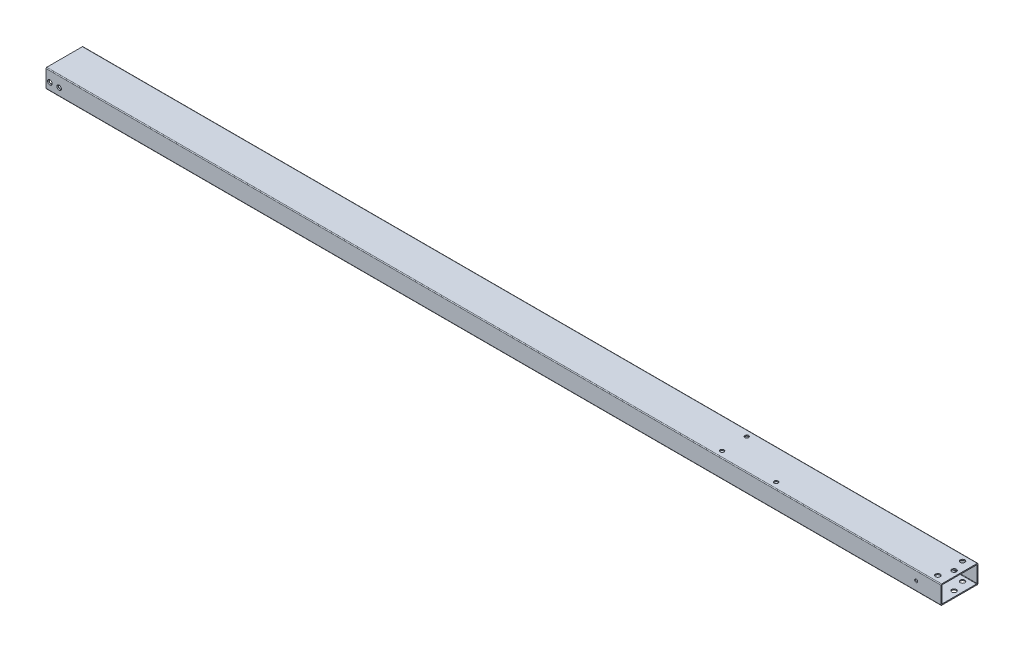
ISO-10303-21;
HEADER;
FILE_DESCRIPTION(('STEP AP214'),'2;1');
FILE_NAME('part.step','',(''),(''),'','','');
FILE_SCHEMA(('AUTOMOTIVE_DESIGN { 1 0 10303 214 1 1 1 1 }'));
ENDSEC;
DATA;
#1=APPLICATION_CONTEXT('core data for automotive mechanical design processes');
#2=APPLICATION_PROTOCOL_DEFINITION('international standard','automotive_design',2000,#1);
#3=PRODUCT_CONTEXT('',#1,'mechanical');
#4=PRODUCT('Part','Part','',(#3));
#5=PRODUCT_RELATED_PRODUCT_CATEGORY('part','',(#4));
#6=PRODUCT_DEFINITION_FORMATION('','',#4);
#7=PRODUCT_DEFINITION_CONTEXT('part definition',#1,'design');
#8=PRODUCT_DEFINITION('design','',#6,#7);
#9=PRODUCT_DEFINITION_SHAPE('','',#8);
#10=(LENGTH_UNIT() NAMED_UNIT(*) SI_UNIT(.MILLI.,.METRE.));
#11=(NAMED_UNIT(*) PLANE_ANGLE_UNIT() SI_UNIT($,.RADIAN.));
#12=(NAMED_UNIT(*) SI_UNIT($,.STERADIAN.) SOLID_ANGLE_UNIT());
#13=UNCERTAINTY_MEASURE_WITH_UNIT(LENGTH_MEASURE(1.E-05),#10,'distance_accuracy_value','');
#14=(GEOMETRIC_REPRESENTATION_CONTEXT(3) GLOBAL_UNCERTAINTY_ASSIGNED_CONTEXT((#13)) GLOBAL_UNIT_ASSIGNED_CONTEXT((#10,
#11,#12)) REPRESENTATION_CONTEXT('',''));
#15=CARTESIAN_POINT('',(0.,0.,0.));
#16=DIRECTION('',(0.,0.,1.));
#17=DIRECTION('',(1.,0.,0.));
#18=AXIS2_PLACEMENT_3D('',#15,#16,#17);
#19=CARTESIAN_POINT('',(1838.325,0.,0.));
#20=DIRECTION('',(1.,0.,0.));
#21=DIRECTION('',(0.,0.,-1.));
#22=AXIS2_PLACEMENT_3D('',#19,#20,#21);
#23=PLANE('',#22);
#24=DIRECTION('',(0.,0.,1.));
#25=VECTOR('',#24,1.);
#26=CARTESIAN_POINT('',(1838.325,19.05,-38.1));
#27=LINE('',#26,#25);
#28=CARTESIAN_POINT('',(1838.325,19.05,-36.5252));
#29=VERTEX_POINT('',#28);
#30=CARTESIAN_POINT('',(1838.325,19.05,36.5252));
#31=VERTEX_POINT('',#30);
#32=EDGE_CURVE('E200',#29,#31,#27,.T.);
#33=ORIENTED_EDGE('',*,*,#32,.T.);
#34=CARTESIAN_POINT('',(1838.325,17.4752,36.5252));
#35=DIRECTION('',(1.,0.,0.));
#36=DIRECTION('',(0.,0.,-1.));
#37=AXIS2_PLACEMENT_3D('',#34,#35,#36);
#38=CIRCLE('',#37,1.5748);
#39=CARTESIAN_POINT('',(1838.325,17.4752,38.1));
#40=VERTEX_POINT('',#39);
#41=EDGE_CURVE('E259',#31,#40,#38,.T.);
#42=ORIENTED_EDGE('',*,*,#41,.T.);
#43=DIRECTION('',(0.,-1.,0.));
#44=VECTOR('',#43,1.);
#45=CARTESIAN_POINT('',(1838.325,19.05,38.1));
#46=LINE('',#45,#44);
#47=CARTESIAN_POINT('',(1838.325,-17.4752,38.1));
#48=VERTEX_POINT('',#47);
#49=EDGE_CURVE('E414',#40,#48,#46,.T.);
#50=ORIENTED_EDGE('',*,*,#49,.T.);
#51=CARTESIAN_POINT('',(1838.325,-17.4752,36.5252));
#52=DIRECTION('',(1.,0.,0.));
#53=DIRECTION('',(0.,0.,-1.));
#54=AXIS2_PLACEMENT_3D('',#51,#52,#53);
#55=CIRCLE('',#54,1.5748);
#56=CARTESIAN_POINT('',(1838.325,-19.05,36.5252));
#57=VERTEX_POINT('',#56);
#58=EDGE_CURVE('E257',#48,#57,#55,.T.);
#59=ORIENTED_EDGE('',*,*,#58,.T.);
#60=DIRECTION('',(0.,0.,-1.));
#61=VECTOR('',#60,1.);
#62=CARTESIAN_POINT('',(1838.325,-19.05,-38.1));
#63=LINE('',#62,#61);
#64=CARTESIAN_POINT('',(1838.325,-19.05,-36.5252));
#65=VERTEX_POINT('',#64);
#66=EDGE_CURVE('E417',#57,#65,#63,.T.);
#67=ORIENTED_EDGE('',*,*,#66,.T.);
#68=CARTESIAN_POINT('',(1838.325,-17.4752,-36.5252));
#69=DIRECTION('',(1.,0.,0.));
#70=DIRECTION('',(0.,0.,-1.));
#71=AXIS2_PLACEMENT_3D('',#68,#69,#70);
#72=CIRCLE('',#71,1.5748);
#73=CARTESIAN_POINT('',(1838.325,-17.4752,-38.1));
#74=VERTEX_POINT('',#73);
#75=EDGE_CURVE('E81',#65,#74,#72,.T.);
#76=ORIENTED_EDGE('',*,*,#75,.T.);
#77=DIRECTION('',(0.,1.,0.));
#78=VECTOR('',#77,1.);
#79=CARTESIAN_POINT('',(1838.325,19.05,-38.1));
#80=LINE('',#79,#78);
#81=CARTESIAN_POINT('',(1838.325,17.4752,-38.1));
#82=VERTEX_POINT('',#81);
#83=EDGE_CURVE('E205',#74,#82,#80,.T.);
#84=ORIENTED_EDGE('',*,*,#83,.T.);
#85=CARTESIAN_POINT('',(1838.325,17.4752,-36.5252));
#86=DIRECTION('',(1.,0.,0.));
#87=DIRECTION('',(0.,0.,-1.));
#88=AXIS2_PLACEMENT_3D('',#85,#86,#87);
#89=CIRCLE('',#88,1.5748);
#90=EDGE_CURVE('E254',#82,#29,#89,.T.);
#91=ORIENTED_EDGE('',*,*,#90,.T.);
#92=EDGE_LOOP('',(#33,#42,#50,#59,#67,#76,#84,#91));
#93=FACE_BOUND('',#92,.T.);
#94=DIRECTION('',(0.,0.,-1.));
#95=VECTOR('',#94,1.);
#96=CARTESIAN_POINT('',(1838.325,-16.9418,0.));
#97=LINE('',#96,#95);
#98=CARTESIAN_POINT('',(1838.325,-16.9418,35.2044));
#99=VERTEX_POINT('',#98);
#100=CARTESIAN_POINT('',(1838.325,-16.9418,-35.2044));
#101=VERTEX_POINT('',#100);
#102=EDGE_CURVE('E398',#99,#101,#97,.T.);
#103=ORIENTED_EDGE('',*,*,#102,.F.);
#104=CARTESIAN_POINT('',(1838.325,-16.1544,35.2044));
#105=DIRECTION('',(1.,0.,0.));
#106=DIRECTION('',(0.,0.,-1.));
#107=AXIS2_PLACEMENT_3D('',#104,#105,#106);
#108=CIRCLE('',#107,0.7874);
#109=CARTESIAN_POINT('',(1838.325,-16.1544,35.9918));
#110=VERTEX_POINT('',#109);
#111=EDGE_CURVE('E226',#99,#110,#108,.F.);
#112=ORIENTED_EDGE('',*,*,#111,.T.);
#113=DIRECTION('',(0.,-1.,0.));
#114=VECTOR('',#113,1.);
#115=CARTESIAN_POINT('',(1838.325,0.,35.9918));
#116=LINE('',#115,#114);
#117=CARTESIAN_POINT('',(1838.325,16.1544,35.9918));
#118=VERTEX_POINT('',#117);
#119=EDGE_CURVE('E396',#118,#110,#116,.T.);
#120=ORIENTED_EDGE('',*,*,#119,.F.);
#121=CARTESIAN_POINT('',(1838.325,16.1544,35.2044));
#122=DIRECTION('',(1.,0.,0.));
#123=DIRECTION('',(0.,0.,-1.));
#124=AXIS2_PLACEMENT_3D('',#121,#122,#123);
#125=CIRCLE('',#124,0.7874);
#126=CARTESIAN_POINT('',(1838.325,16.9418,35.2044));
#127=VERTEX_POINT('',#126);
#128=EDGE_CURVE('E184',#118,#127,#125,.F.);
#129=ORIENTED_EDGE('',*,*,#128,.T.);
#130=DIRECTION('',(0.,0.,1.));
#131=VECTOR('',#130,1.);
#132=CARTESIAN_POINT('',(1838.325,16.9418,0.));
#133=LINE('',#132,#131);
#134=CARTESIAN_POINT('',(1838.325,16.9418,-35.2044));
#135=VERTEX_POINT('',#134);
#136=EDGE_CURVE('E404',#135,#127,#133,.T.);
#137=ORIENTED_EDGE('',*,*,#136,.F.);
#138=CARTESIAN_POINT('',(1838.325,16.1544,-35.2044));
#139=DIRECTION('',(1.,0.,0.));
#140=DIRECTION('',(0.,0.,-1.));
#141=AXIS2_PLACEMENT_3D('',#138,#139,#140);
#142=CIRCLE('',#141,0.7874);
#143=CARTESIAN_POINT('',(1838.325,16.1544,-35.9918));
#144=VERTEX_POINT('',#143);
#145=EDGE_CURVE('E185',#135,#144,#142,.F.);
#146=ORIENTED_EDGE('',*,*,#145,.T.);
#147=DIRECTION('',(0.,1.,0.));
#148=VECTOR('',#147,1.);
#149=CARTESIAN_POINT('',(1838.325,0.,-35.9918));
#150=LINE('',#149,#148);
#151=CARTESIAN_POINT('',(1838.325,-16.1544,-35.9918));
#152=VERTEX_POINT('',#151);
#153=EDGE_CURVE('E401',#152,#144,#150,.T.);
#154=ORIENTED_EDGE('',*,*,#153,.F.);
#155=CARTESIAN_POINT('',(1838.325,-16.1544,-35.2044));
#156=DIRECTION('',(1.,0.,0.));
#157=DIRECTION('',(0.,0.,-1.));
#158=AXIS2_PLACEMENT_3D('',#155,#156,#157);
#159=CIRCLE('',#158,0.7874);
#160=EDGE_CURVE('E230',#152,#101,#159,.F.);
#161=ORIENTED_EDGE('',*,*,#160,.T.);
#162=EDGE_LOOP('',(#103,#112,#120,#129,#137,#146,#154,#161));
#163=FACE_BOUND('',#162,.T.);
#164=ADVANCED_FACE('F57',(#93,#163),#23,.T.);
#165=CARTESIAN_POINT('',(0.,0.,0.));
#166=DIRECTION('',(1.,0.,0.));
#167=DIRECTION('',(0.,0.,-1.));
#168=AXIS2_PLACEMENT_3D('',#165,#166,#167);
#169=PLANE('',#168);
#170=DIRECTION('',(0.,-1.,0.));
#171=VECTOR('',#170,1.);
#172=CARTESIAN_POINT('',(0.,19.05,38.1));
#173=LINE('',#172,#171);
#174=CARTESIAN_POINT('',(0.,17.4752,38.1));
#175=VERTEX_POINT('',#174);
#176=CARTESIAN_POINT('',(0.,-17.4752,38.1));
#177=VERTEX_POINT('',#176);
#178=EDGE_CURVE('E406',#175,#177,#173,.T.);
#179=ORIENTED_EDGE('',*,*,#178,.F.);
#180=CARTESIAN_POINT('',(0.,17.4752,36.5252));
#181=DIRECTION('',(1.,0.,0.));
#182=DIRECTION('',(0.,0.,-1.));
#183=AXIS2_PLACEMENT_3D('',#180,#181,#182);
#184=CIRCLE('',#183,1.5748);
#185=CARTESIAN_POINT('',(0.,19.05,36.5252));
#186=VERTEX_POINT('',#185);
#187=EDGE_CURVE('E247',#175,#186,#184,.F.);
#188=ORIENTED_EDGE('',*,*,#187,.T.);
#189=DIRECTION('',(0.,0.,1.));
#190=VECTOR('',#189,1.);
#191=CARTESIAN_POINT('',(0.,19.05,-38.1));
#192=LINE('',#191,#190);
#193=CARTESIAN_POINT('',(0.,19.05,-36.5252));
#194=VERTEX_POINT('',#193);
#195=EDGE_CURVE('E208',#194,#186,#192,.T.);
#196=ORIENTED_EDGE('',*,*,#195,.F.);
#197=CARTESIAN_POINT('',(0.,17.4752,-36.5252));
#198=DIRECTION('',(1.,0.,0.));
#199=DIRECTION('',(0.,0.,-1.));
#200=AXIS2_PLACEMENT_3D('',#197,#198,#199);
#201=CIRCLE('',#200,1.5748);
#202=CARTESIAN_POINT('',(0.,17.4752,-38.1));
#203=VERTEX_POINT('',#202);
#204=EDGE_CURVE('E241',#194,#203,#201,.F.);
#205=ORIENTED_EDGE('',*,*,#204,.T.);
#206=DIRECTION('',(0.,1.,0.));
#207=VECTOR('',#206,1.);
#208=CARTESIAN_POINT('',(0.,19.05,-38.1));
#209=LINE('',#208,#207);
#210=CARTESIAN_POINT('',(0.,-17.4752,-38.1));
#211=VERTEX_POINT('',#210);
#212=EDGE_CURVE('E424',#211,#203,#209,.T.);
#213=ORIENTED_EDGE('',*,*,#212,.F.);
#214=CARTESIAN_POINT('',(0.,-17.4752,-36.5252));
#215=DIRECTION('',(1.,0.,0.));
#216=DIRECTION('',(0.,0.,-1.));
#217=AXIS2_PLACEMENT_3D('',#214,#215,#216);
#218=CIRCLE('',#217,1.5748);
#219=CARTESIAN_POINT('',(0.,-19.05,-36.5252));
#220=VERTEX_POINT('',#219);
#221=EDGE_CURVE('E243',#211,#220,#218,.F.);
#222=ORIENTED_EDGE('',*,*,#221,.T.);
#223=DIRECTION('',(0.,0.,-1.));
#224=VECTOR('',#223,1.);
#225=CARTESIAN_POINT('',(0.,-19.05,-38.1));
#226=LINE('',#225,#224);
#227=CARTESIAN_POINT('',(0.,-19.05,36.5252));
#228=VERTEX_POINT('',#227);
#229=EDGE_CURVE('E422',#228,#220,#226,.T.);
#230=ORIENTED_EDGE('',*,*,#229,.F.);
#231=CARTESIAN_POINT('',(0.,-17.4752,36.5252));
#232=DIRECTION('',(1.,0.,0.));
#233=DIRECTION('',(0.,0.,-1.));
#234=AXIS2_PLACEMENT_3D('',#231,#232,#233);
#235=CIRCLE('',#234,1.5748);
#236=EDGE_CURVE('E245',#228,#177,#235,.F.);
#237=ORIENTED_EDGE('',*,*,#236,.T.);
#238=EDGE_LOOP('',(#179,#188,#196,#205,#213,#222,#230,#237));
#239=FACE_BOUND('',#238,.T.);
#240=DIRECTION('',(0.,0.,1.));
#241=VECTOR('',#240,1.);
#242=CARTESIAN_POINT('',(0.,16.9418,0.));
#243=LINE('',#242,#241);
#244=CARTESIAN_POINT('',(0.,16.9418,-35.2044));
#245=VERTEX_POINT('',#244);
#246=CARTESIAN_POINT('',(0.,16.9418,35.2044));
#247=VERTEX_POINT('',#246);
#248=EDGE_CURVE('E179',#245,#247,#243,.T.);
#249=ORIENTED_EDGE('',*,*,#248,.T.);
#250=CARTESIAN_POINT('',(0.,16.1544,35.2044));
#251=DIRECTION('',(1.,0.,0.));
#252=DIRECTION('',(0.,0.,-1.));
#253=AXIS2_PLACEMENT_3D('',#250,#251,#252);
#254=CIRCLE('',#253,0.7874);
#255=CARTESIAN_POINT('',(0.,16.1544,35.9918));
#256=VERTEX_POINT('',#255);
#257=EDGE_CURVE('E174',#247,#256,#254,.T.);
#258=ORIENTED_EDGE('',*,*,#257,.T.);
#259=DIRECTION('',(0.,-1.,0.));
#260=VECTOR('',#259,1.);
#261=CARTESIAN_POINT('',(0.,0.,35.9918));
#262=LINE('',#261,#260);
#263=CARTESIAN_POINT('',(0.,-16.1544,35.9918));
#264=VERTEX_POINT('',#263);
#265=EDGE_CURVE('E177',#256,#264,#262,.T.);
#266=ORIENTED_EDGE('',*,*,#265,.T.);
#267=CARTESIAN_POINT('',(0.,-16.1544,35.2044));
#268=DIRECTION('',(1.,0.,0.));
#269=DIRECTION('',(0.,0.,-1.));
#270=AXIS2_PLACEMENT_3D('',#267,#268,#269);
#271=CIRCLE('',#270,0.7874);
#272=CARTESIAN_POINT('',(0.,-16.9418,35.2044));
#273=VERTEX_POINT('',#272);
#274=EDGE_CURVE('E224',#264,#273,#271,.T.);
#275=ORIENTED_EDGE('',*,*,#274,.T.);
#276=DIRECTION('',(0.,0.,-1.));
#277=VECTOR('',#276,1.);
#278=CARTESIAN_POINT('',(0.,-16.9418,0.));
#279=LINE('',#278,#277);
#280=CARTESIAN_POINT('',(0.,-16.9418,-35.2044));
#281=VERTEX_POINT('',#280);
#282=EDGE_CURVE('E195',#273,#281,#279,.T.);
#283=ORIENTED_EDGE('',*,*,#282,.T.);
#284=CARTESIAN_POINT('',(0.,-16.1544,-35.2044));
#285=DIRECTION('',(1.,0.,0.));
#286=DIRECTION('',(0.,0.,-1.));
#287=AXIS2_PLACEMENT_3D('',#284,#285,#286);
#288=CIRCLE('',#287,0.7874);
#289=CARTESIAN_POINT('',(0.,-16.1544,-35.9918));
#290=VERTEX_POINT('',#289);
#291=EDGE_CURVE('E228',#281,#290,#288,.T.);
#292=ORIENTED_EDGE('',*,*,#291,.T.);
#293=DIRECTION('',(0.,1.,0.));
#294=VECTOR('',#293,1.);
#295=CARTESIAN_POINT('',(0.,0.,-35.9918));
#296=LINE('',#295,#294);
#297=CARTESIAN_POINT('',(0.,16.1544,-35.9918));
#298=VERTEX_POINT('',#297);
#299=EDGE_CURVE('E410',#290,#298,#296,.T.);
#300=ORIENTED_EDGE('',*,*,#299,.T.);
#301=CARTESIAN_POINT('',(0.,16.1544,-35.2044));
#302=DIRECTION('',(1.,0.,0.));
#303=DIRECTION('',(0.,0.,-1.));
#304=AXIS2_PLACEMENT_3D('',#301,#302,#303);
#305=CIRCLE('',#304,0.7874);
#306=EDGE_CURVE('E232',#298,#245,#305,.T.);
#307=ORIENTED_EDGE('',*,*,#306,.T.);
#308=EDGE_LOOP('',(#249,#258,#266,#275,#283,#292,#300,#307));
#309=FACE_BOUND('',#308,.T.);
#310=ADVANCED_FACE('F176',(#239,#309),#169,.F.);
#311=CARTESIAN_POINT('',(1838.325,19.05,38.1));
#312=DIRECTION('',(0.,0.,-1.));
#313=DIRECTION('',(0.,1.,0.));
#314=AXIS2_PLACEMENT_3D('',#311,#312,#313);
#315=PLANE('',#314);
#316=CARTESIAN_POINT('',(1787.525,0.,38.1));
#317=DIRECTION('',(0.,0.,-1.));
#318=DIRECTION('',(0.,1.,0.));
#319=AXIS2_PLACEMENT_3D('',#316,#317,#318);
#320=CIRCLE('',#319,3.17499999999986);
#321=CARTESIAN_POINT('',(1787.525,3.17499999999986,38.1));
#322=VERTEX_POINT('',#321);
#323=EDGE_CURVE('E333',#322,#322,#320,.T.);
#324=ORIENTED_EDGE('',*,*,#323,.T.);
#325=EDGE_LOOP('',(#324));
#326=FACE_BOUND('',#325,.T.);
#327=CARTESIAN_POINT('',(26.9748,-3.175,38.1));
#328=DIRECTION('',(0.,0.,-1.));
#329=DIRECTION('',(0.,1.,0.));
#330=AXIS2_PLACEMENT_3D('',#327,#328,#329);
#331=CIRCLE('',#330,4.69900000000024);
#332=CARTESIAN_POINT('',(26.9748,1.52400000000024,38.1));
#333=VERTEX_POINT('',#332);
#334=EDGE_CURVE('E323',#333,#333,#331,.T.);
#335=ORIENTED_EDGE('',*,*,#334,.T.);
#336=EDGE_LOOP('',(#335));
#337=FACE_BOUND('',#336,.T.);
#338=CARTESIAN_POINT('',(7.9248,-3.175,38.1));
#339=DIRECTION('',(0.,0.,-1.));
#340=DIRECTION('',(0.,1.,0.));
#341=AXIS2_PLACEMENT_3D('',#338,#339,#340);
#342=CIRCLE('',#341,4.69900000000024);
#343=CARTESIAN_POINT('',(7.9248,1.52400000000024,38.1));
#344=VERTEX_POINT('',#343);
#345=EDGE_CURVE('E320',#344,#344,#342,.T.);
#346=ORIENTED_EDGE('',*,*,#345,.T.);
#347=EDGE_LOOP('',(#346));
#348=FACE_BOUND('',#347,.T.);
#349=ORIENTED_EDGE('',*,*,#49,.F.);
#350=DIRECTION('',(-1.,0.,0.));
#351=VECTOR('',#350,1.);
#352=CARTESIAN_POINT('',(1838.325,17.4752,38.1));
#353=LINE('',#352,#351);
#354=EDGE_CURVE('E238',#40,#175,#353,.T.);
#355=ORIENTED_EDGE('',*,*,#354,.T.);
#356=ORIENTED_EDGE('',*,*,#178,.T.);
#357=DIRECTION('',(-1.,0.,0.));
#358=VECTOR('',#357,1.);
#359=CARTESIAN_POINT('',(1838.325,-17.4752,38.1));
#360=LINE('',#359,#358);
#361=EDGE_CURVE('E236',#177,#48,#360,.F.);
#362=ORIENTED_EDGE('',*,*,#361,.T.);
#363=EDGE_LOOP('',(#349,#355,#356,#362));
#364=FACE_BOUND('',#363,.T.);
#365=ADVANCED_FACE('F442',(#326,#337,#348,#364),#315,.F.);
#366=CARTESIAN_POINT('',(1838.325,-19.05,-38.1));
#367=DIRECTION('',(0.,1.,0.));
#368=DIRECTION('',(0.,0.,1.));
#369=AXIS2_PLACEMENT_3D('',#366,#367,#368);
#370=PLANE('',#369);
#371=CARTESIAN_POINT('',(17.4498,-19.05,14.2875));
#372=DIRECTION('',(0.,1.,0.));
#373=DIRECTION('',(0.,0.,1.));
#374=AXIS2_PLACEMENT_3D('',#371,#372,#373);
#375=CIRCLE('',#374,4.7625);
#376=CARTESIAN_POINT('',(17.4498,-19.05,19.05));
#377=VERTEX_POINT('',#376);
#378=EDGE_CURVE('E330',#377,#377,#375,.T.);
#379=ORIENTED_EDGE('',*,*,#378,.T.);
#380=EDGE_LOOP('',(#379));
#381=FACE_BOUND('',#380,.T.);
#382=CARTESIAN_POINT('',(17.4498,-19.05,-14.2875));
#383=DIRECTION('',(0.,1.,0.));
#384=DIRECTION('',(0.,0.,1.));
#385=AXIS2_PLACEMENT_3D('',#382,#383,#384);
#386=CIRCLE('',#385,4.7625);
#387=CARTESIAN_POINT('',(17.4498,-19.05,-9.525));
#388=VERTEX_POINT('',#387);
#389=EDGE_CURVE('E308',#388,#388,#386,.T.);
#390=ORIENTED_EDGE('',*,*,#389,.T.);
#391=EDGE_LOOP('',(#390));
#392=FACE_BOUND('',#391,.T.);
#393=CARTESIAN_POINT('',(1376.045,-19.05,25.4));
#394=DIRECTION('',(0.,1.,0.));
#395=DIRECTION('',(0.,0.,1.));
#396=AXIS2_PLACEMENT_3D('',#393,#394,#395);
#397=CIRCLE('',#396,3.96240000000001);
#398=CARTESIAN_POINT('',(1376.045,-19.05,29.3624));
#399=VERTEX_POINT('',#398);
#400=EDGE_CURVE('E295',#399,#399,#397,.T.);
#401=ORIENTED_EDGE('',*,*,#400,.T.);
#402=EDGE_LOOP('',(#401));
#403=FACE_BOUND('',#402,.T.);
#404=CARTESIAN_POINT('',(1487.17,-19.05,25.4));
#405=DIRECTION('',(0.,1.,0.));
#406=DIRECTION('',(0.,0.,1.));
#407=AXIS2_PLACEMENT_3D('',#404,#405,#406);
#408=CIRCLE('',#407,3.96240000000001);
#409=CARTESIAN_POINT('',(1487.17,-19.05,29.3624));
#410=VERTEX_POINT('',#409);
#411=EDGE_CURVE('E290',#410,#410,#408,.T.);
#412=ORIENTED_EDGE('',*,*,#411,.T.);
#413=EDGE_LOOP('',(#412));
#414=FACE_BOUND('',#413,.T.);
#415=CARTESIAN_POINT('',(1376.045,-19.05,-25.4));
#416=DIRECTION('',(0.,1.,0.));
#417=DIRECTION('',(0.,0.,1.));
#418=AXIS2_PLACEMENT_3D('',#415,#416,#417);
#419=CIRCLE('',#418,3.96240000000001);
#420=CARTESIAN_POINT('',(1376.045,-19.05,-21.4376));
#421=VERTEX_POINT('',#420);
#422=EDGE_CURVE('E285',#421,#421,#419,.T.);
#423=ORIENTED_EDGE('',*,*,#422,.T.);
#424=EDGE_LOOP('',(#423));
#425=FACE_BOUND('',#424,.T.);
#426=CARTESIAN_POINT('',(1827.1998,-19.05,0.));
#427=DIRECTION('',(0.,1.,0.));
#428=DIRECTION('',(0.,0.,1.));
#429=AXIS2_PLACEMENT_3D('',#426,#427,#428);
#430=CIRCLE('',#429,4.76249999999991);
#431=CARTESIAN_POINT('',(1827.1998,-19.05,4.76249999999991));
#432=VERTEX_POINT('',#431);
#433=EDGE_CURVE('E280',#432,#432,#430,.T.);
#434=ORIENTED_EDGE('',*,*,#433,.T.);
#435=EDGE_LOOP('',(#434));
#436=FACE_BOUND('',#435,.T.);
#437=CARTESIAN_POINT('',(1819.275,-19.05,-25.4));
#438=DIRECTION('',(0.,1.,0.));
#439=DIRECTION('',(0.,0.,1.));
#440=AXIS2_PLACEMENT_3D('',#437,#438,#439);
#441=CIRCLE('',#440,4.76249999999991);
#442=CARTESIAN_POINT('',(1819.275,-19.05,-20.6375000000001));
#443=VERTEX_POINT('',#442);
#444=EDGE_CURVE('E275',#443,#443,#441,.T.);
#445=ORIENTED_EDGE('',*,*,#444,.T.);
#446=EDGE_LOOP('',(#445));
#447=FACE_BOUND('',#446,.T.);
#448=CARTESIAN_POINT('',(1819.275,-19.05,25.4));
#449=DIRECTION('',(0.,1.,0.));
#450=DIRECTION('',(0.,0.,1.));
#451=AXIS2_PLACEMENT_3D('',#448,#449,#450);
#452=CIRCLE('',#451,4.76249999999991);
#453=CARTESIAN_POINT('',(1819.275,-19.05,30.1624999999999));
#454=VERTEX_POINT('',#453);
#455=EDGE_CURVE('E196',#454,#454,#452,.T.);
#456=ORIENTED_EDGE('',*,*,#455,.T.);
#457=EDGE_LOOP('',(#456));
#458=FACE_BOUND('',#457,.T.);
#459=ORIENTED_EDGE('',*,*,#66,.F.);
#460=DIRECTION('',(-1.,0.,0.));
#461=VECTOR('',#460,1.);
#462=CARTESIAN_POINT('',(1838.325,-19.05,36.5252));
#463=LINE('',#462,#461);
#464=EDGE_CURVE('E263',#57,#228,#463,.T.);
#465=ORIENTED_EDGE('',*,*,#464,.T.);
#466=ORIENTED_EDGE('',*,*,#229,.T.);
#467=DIRECTION('',(-1.,0.,0.));
#468=VECTOR('',#467,1.);
#469=CARTESIAN_POINT('',(1838.325,-19.05,-36.5252));
#470=LINE('',#469,#468);
#471=EDGE_CURVE('E261',#220,#65,#470,.F.);
#472=ORIENTED_EDGE('',*,*,#471,.T.);
#473=EDGE_LOOP('',(#459,#465,#466,#472));
#474=FACE_BOUND('',#473,.T.);
#475=ADVANCED_FACE('F450',(#381,#392,#403,#414,#425,#436,#447,#458,#474),#370,.F.);
#476=CARTESIAN_POINT('',(1838.325,19.05,-38.1));
#477=DIRECTION('',(0.,0.,1.));
#478=DIRECTION('',(0.,-1.,0.));
#479=AXIS2_PLACEMENT_3D('',#476,#477,#478);
#480=PLANE('',#479);
#481=CARTESIAN_POINT('',(1787.525,0.,-38.1));
#482=DIRECTION('',(0.,0.,1.));
#483=DIRECTION('',(0.,-1.,0.));
#484=AXIS2_PLACEMENT_3D('',#481,#482,#483);
#485=CIRCLE('',#484,3.17499999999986);
#486=CARTESIAN_POINT('',(1787.525,-3.17499999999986,-38.1));
#487=VERTEX_POINT('',#486);
#488=EDGE_CURVE('E339',#487,#487,#485,.T.);
#489=ORIENTED_EDGE('',*,*,#488,.T.);
#490=EDGE_LOOP('',(#489));
#491=FACE_BOUND('',#490,.T.);
#492=CARTESIAN_POINT('',(7.9248,-3.175,-38.1));
#493=DIRECTION('',(0.,0.,1.));
#494=DIRECTION('',(0.,-1.,0.));
#495=AXIS2_PLACEMENT_3D('',#492,#493,#494);
#496=CIRCLE('',#495,4.69900000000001);
#497=CARTESIAN_POINT('',(7.9248,-7.87400000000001,-38.1));
#498=VERTEX_POINT('',#497);
#499=EDGE_CURVE('E311',#498,#498,#496,.T.);
#500=ORIENTED_EDGE('',*,*,#499,.T.);
#501=EDGE_LOOP('',(#500));
#502=FACE_BOUND('',#501,.T.);
#503=CARTESIAN_POINT('',(26.9748,-3.175,-38.1));
#504=DIRECTION('',(0.,0.,1.));
#505=DIRECTION('',(0.,-1.,0.));
#506=AXIS2_PLACEMENT_3D('',#503,#504,#505);
#507=CIRCLE('',#506,4.69900000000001);
#508=CARTESIAN_POINT('',(26.9748,-7.87400000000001,-38.1));
#509=VERTEX_POINT('',#508);
#510=EDGE_CURVE('E270',#509,#509,#507,.T.);
#511=ORIENTED_EDGE('',*,*,#510,.T.);
#512=EDGE_LOOP('',(#511));
#513=FACE_BOUND('',#512,.T.);
#514=ORIENTED_EDGE('',*,*,#83,.F.);
#515=DIRECTION('',(-1.,0.,0.));
#516=VECTOR('',#515,1.);
#517=CARTESIAN_POINT('',(1838.325,-17.4752,-38.1));
#518=LINE('',#517,#516);
#519=EDGE_CURVE('E267',#74,#211,#518,.T.);
#520=ORIENTED_EDGE('',*,*,#519,.T.);
#521=ORIENTED_EDGE('',*,*,#212,.T.);
#522=DIRECTION('',(-1.,0.,0.));
#523=VECTOR('',#522,1.);
#524=CARTESIAN_POINT('',(1838.325,17.4752,-38.1));
#525=LINE('',#524,#523);
#526=EDGE_CURVE('E74',#203,#82,#525,.F.);
#527=ORIENTED_EDGE('',*,*,#526,.T.);
#528=EDGE_LOOP('',(#514,#520,#521,#527));
#529=FACE_BOUND('',#528,.T.);
#530=ADVANCED_FACE('F456',(#491,#502,#513,#529),#480,.F.);
#531=CARTESIAN_POINT('',(1838.325,19.05,-38.1));
#532=DIRECTION('',(0.,-1.,0.));
#533=DIRECTION('',(0.,0.,-1.));
#534=AXIS2_PLACEMENT_3D('',#531,#532,#533);
#535=PLANE('',#534);
#536=CARTESIAN_POINT('',(1376.045,19.05,25.4));
#537=DIRECTION('',(0.,-1.,0.));
#538=DIRECTION('',(0.,0.,-1.));
#539=AXIS2_PLACEMENT_3D('',#536,#537,#538);
#540=CIRCLE('',#539,3.96240000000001);
#541=CARTESIAN_POINT('',(1376.045,19.05,21.4376));
#542=VERTEX_POINT('',#541);
#543=EDGE_CURVE('E356',#542,#542,#540,.T.);
#544=ORIENTED_EDGE('',*,*,#543,.T.);
#545=EDGE_LOOP('',(#544));
#546=FACE_BOUND('',#545,.T.);
#547=CARTESIAN_POINT('',(1487.17,19.05,25.4));
#548=DIRECTION('',(0.,-1.,0.));
#549=DIRECTION('',(0.,0.,-1.));
#550=AXIS2_PLACEMENT_3D('',#547,#548,#549);
#551=CIRCLE('',#550,3.96240000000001);
#552=CARTESIAN_POINT('',(1487.17,19.05,21.4376));
#553=VERTEX_POINT('',#552);
#554=EDGE_CURVE('E363',#553,#553,#551,.T.);
#555=ORIENTED_EDGE('',*,*,#554,.T.);
#556=EDGE_LOOP('',(#555));
#557=FACE_BOUND('',#556,.T.);
#558=CARTESIAN_POINT('',(1376.045,19.05,-25.4));
#559=DIRECTION('',(0.,-1.,0.));
#560=DIRECTION('',(0.,0.,-1.));
#561=AXIS2_PLACEMENT_3D('',#558,#559,#560);
#562=CIRCLE('',#561,3.96240000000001);
#563=CARTESIAN_POINT('',(1376.045,19.05,-29.3624));
#564=VERTEX_POINT('',#563);
#565=EDGE_CURVE('E370',#564,#564,#562,.T.);
#566=ORIENTED_EDGE('',*,*,#565,.T.);
#567=EDGE_LOOP('',(#566));
#568=FACE_BOUND('',#567,.T.);
#569=CARTESIAN_POINT('',(1827.1998,19.05,0.));
#570=DIRECTION('',(0.,-1.,0.));
#571=DIRECTION('',(0.,0.,-1.));
#572=AXIS2_PLACEMENT_3D('',#569,#570,#571);
#573=CIRCLE('',#572,4.76249999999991);
#574=CARTESIAN_POINT('',(1827.1998,19.05,-4.76249999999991));
#575=VERTEX_POINT('',#574);
#576=EDGE_CURVE('E377',#575,#575,#573,.T.);
#577=ORIENTED_EDGE('',*,*,#576,.T.);
#578=EDGE_LOOP('',(#577));
#579=FACE_BOUND('',#578,.T.);
#580=CARTESIAN_POINT('',(1819.275,19.05,-25.4));
#581=DIRECTION('',(0.,-1.,0.));
#582=DIRECTION('',(0.,0.,-1.));
#583=AXIS2_PLACEMENT_3D('',#580,#581,#582);
#584=CIRCLE('',#583,4.76249999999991);
#585=CARTESIAN_POINT('',(1819.275,19.05,-30.1624999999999));
#586=VERTEX_POINT('',#585);
#587=EDGE_CURVE('E384',#586,#586,#584,.T.);
#588=ORIENTED_EDGE('',*,*,#587,.T.);
#589=EDGE_LOOP('',(#588));
#590=FACE_BOUND('',#589,.T.);
#591=CARTESIAN_POINT('',(1819.275,19.05,25.4));
#592=DIRECTION('',(0.,-1.,0.));
#593=DIRECTION('',(0.,0.,-1.));
#594=AXIS2_PLACEMENT_3D('',#591,#592,#593);
#595=CIRCLE('',#594,4.76249999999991);
#596=CARTESIAN_POINT('',(1819.275,19.05,20.6375000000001));
#597=VERTEX_POINT('',#596);
#598=EDGE_CURVE('E391',#597,#597,#595,.T.);
#599=ORIENTED_EDGE('',*,*,#598,.T.);
#600=EDGE_LOOP('',(#599));
#601=FACE_BOUND('',#600,.T.);
#602=ORIENTED_EDGE('',*,*,#195,.T.);
#603=DIRECTION('',(-1.,0.,0.));
#604=VECTOR('',#603,1.);
#605=CARTESIAN_POINT('',(1838.325,19.05,36.5252));
#606=LINE('',#605,#604);
#607=EDGE_CURVE('E252',#186,#31,#606,.F.);
#608=ORIENTED_EDGE('',*,*,#607,.T.);
#609=ORIENTED_EDGE('',*,*,#32,.F.);
#610=DIRECTION('',(-1.,0.,0.));
#611=VECTOR('',#610,1.);
#612=CARTESIAN_POINT('',(1838.325,19.05,-36.5252));
#613=LINE('',#612,#611);
#614=EDGE_CURVE('E249',#29,#194,#613,.T.);
#615=ORIENTED_EDGE('',*,*,#614,.T.);
#616=EDGE_LOOP('',(#602,#608,#609,#615));
#617=FACE_BOUND('',#616,.T.);
#618=ADVANCED_FACE('F430',(#546,#557,#568,#579,#590,#601,#617),#535,.F.);
#619=CARTESIAN_POINT('',(1838.325,0.,35.9918));
#620=DIRECTION('',(0.,0.,-1.));
#621=DIRECTION('',(0.,1.,0.));
#622=AXIS2_PLACEMENT_3D('',#619,#620,#621);
#623=PLANE('',#622);
#624=CARTESIAN_POINT('',(1787.525,0.,35.9918));
#625=DIRECTION('',(0.,0.,-1.));
#626=DIRECTION('',(0.,1.,0.));
#627=AXIS2_PLACEMENT_3D('',#624,#625,#626);
#628=CIRCLE('',#627,3.17499999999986);
#629=CARTESIAN_POINT('',(1787.525,3.17499999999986,35.9918));
#630=VERTEX_POINT('',#629);
#631=EDGE_CURVE('E344',#630,#630,#628,.T.);
#632=ORIENTED_EDGE('',*,*,#631,.F.);
#633=EDGE_LOOP('',(#632));
#634=FACE_BOUND('',#633,.T.);
#635=CARTESIAN_POINT('',(26.9748,-3.175,35.9918));
#636=DIRECTION('',(0.,0.,-1.));
#637=DIRECTION('',(0.,1.,0.));
#638=AXIS2_PLACEMENT_3D('',#635,#636,#637);
#639=CIRCLE('',#638,3.175);
#640=CARTESIAN_POINT('',(26.9748,0.,35.9918));
#641=VERTEX_POINT('',#640);
#642=EDGE_CURVE('E304',#641,#641,#639,.T.);
#643=ORIENTED_EDGE('',*,*,#642,.F.);
#644=EDGE_LOOP('',(#643));
#645=FACE_BOUND('',#644,.T.);
#646=CARTESIAN_POINT('',(7.9248,-3.175,35.9918));
#647=DIRECTION('',(0.,0.,-1.));
#648=DIRECTION('',(0.,1.,0.));
#649=AXIS2_PLACEMENT_3D('',#646,#647,#648);
#650=CIRCLE('',#649,3.175);
#651=CARTESIAN_POINT('',(7.9248,0.,35.9918));
#652=VERTEX_POINT('',#651);
#653=EDGE_CURVE('E300',#652,#652,#650,.T.);
#654=ORIENTED_EDGE('',*,*,#653,.F.);
#655=EDGE_LOOP('',(#654));
#656=FACE_BOUND('',#655,.T.);
#657=ORIENTED_EDGE('',*,*,#119,.T.);
#658=DIRECTION('',(-1.,0.,0.));
#659=VECTOR('',#658,1.);
#660=CARTESIAN_POINT('',(0.,-16.1544,35.9918));
#661=LINE('',#660,#659);
#662=EDGE_CURVE('E194',#110,#264,#661,.T.);
#663=ORIENTED_EDGE('',*,*,#662,.T.);
#664=ORIENTED_EDGE('',*,*,#265,.F.);
#665=DIRECTION('',(-1.,0.,0.));
#666=VECTOR('',#665,1.);
#667=CARTESIAN_POINT('',(1838.325,16.1544,35.9918));
#668=LINE('',#667,#666);
#669=EDGE_CURVE('E191',#256,#118,#668,.F.);
#670=ORIENTED_EDGE('',*,*,#669,.T.);
#671=EDGE_LOOP('',(#657,#663,#664,#670));
#672=FACE_BOUND('',#671,.T.);
#673=ADVANCED_FACE('F190',(#634,#645,#656,#672),#623,.T.);
#674=CARTESIAN_POINT('',(1838.325,-16.9418,0.));
#675=DIRECTION('',(0.,1.,0.));
#676=DIRECTION('',(0.,0.,1.));
#677=AXIS2_PLACEMENT_3D('',#674,#675,#676);
#678=PLANE('',#677);
#679=CARTESIAN_POINT('',(17.4498,-16.9418,14.2875));
#680=DIRECTION('',(0.,1.,0.));
#681=DIRECTION('',(0.,0.,1.));
#682=AXIS2_PLACEMENT_3D('',#679,#680,#681);
#683=CIRCLE('',#682,4.7625);
#684=CARTESIAN_POINT('',(17.4498,-16.9418,19.05));
#685=VERTEX_POINT('',#684);
#686=EDGE_CURVE('E331',#685,#685,#683,.T.);
#687=ORIENTED_EDGE('',*,*,#686,.F.);
#688=EDGE_LOOP('',(#687));
#689=FACE_BOUND('',#688,.T.);
#690=CARTESIAN_POINT('',(17.4498,-16.9418,-14.2875));
#691=DIRECTION('',(0.,1.,0.));
#692=DIRECTION('',(0.,0.,1.));
#693=AXIS2_PLACEMENT_3D('',#690,#691,#692);
#694=CIRCLE('',#693,4.7625);
#695=CARTESIAN_POINT('',(17.4498,-16.9418,-9.525));
#696=VERTEX_POINT('',#695);
#697=EDGE_CURVE('E328',#696,#696,#694,.T.);
#698=ORIENTED_EDGE('',*,*,#697,.F.);
#699=EDGE_LOOP('',(#698));
#700=FACE_BOUND('',#699,.T.);
#701=CARTESIAN_POINT('',(1376.045,-16.9418,25.4));
#702=DIRECTION('',(0.,1.,0.));
#703=DIRECTION('',(0.,0.,1.));
#704=AXIS2_PLACEMENT_3D('',#701,#702,#703);
#705=CIRCLE('',#704,3.96240000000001);
#706=CARTESIAN_POINT('',(1376.045,-16.9418,29.3624));
#707=VERTEX_POINT('',#706);
#708=EDGE_CURVE('E299',#707,#707,#705,.T.);
#709=ORIENTED_EDGE('',*,*,#708,.F.);
#710=EDGE_LOOP('',(#709));
#711=FACE_BOUND('',#710,.T.);
#712=CARTESIAN_POINT('',(1487.17,-16.9418,25.4));
#713=DIRECTION('',(0.,1.,0.));
#714=DIRECTION('',(0.,0.,1.));
#715=AXIS2_PLACEMENT_3D('',#712,#713,#714);
#716=CIRCLE('',#715,3.96240000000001);
#717=CARTESIAN_POINT('',(1487.17,-16.9418,29.3624));
#718=VERTEX_POINT('',#717);
#719=EDGE_CURVE('E294',#718,#718,#716,.T.);
#720=ORIENTED_EDGE('',*,*,#719,.F.);
#721=EDGE_LOOP('',(#720));
#722=FACE_BOUND('',#721,.T.);
#723=CARTESIAN_POINT('',(1376.045,-16.9418,-25.4));
#724=DIRECTION('',(0.,1.,0.));
#725=DIRECTION('',(0.,0.,1.));
#726=AXIS2_PLACEMENT_3D('',#723,#724,#725);
#727=CIRCLE('',#726,3.96240000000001);
#728=CARTESIAN_POINT('',(1376.045,-16.9418,-21.4376));
#729=VERTEX_POINT('',#728);
#730=EDGE_CURVE('E289',#729,#729,#727,.T.);
#731=ORIENTED_EDGE('',*,*,#730,.F.);
#732=EDGE_LOOP('',(#731));
#733=FACE_BOUND('',#732,.T.);
#734=CARTESIAN_POINT('',(1827.1998,-16.9418,0.));
#735=DIRECTION('',(0.,1.,0.));
#736=DIRECTION('',(0.,0.,1.));
#737=AXIS2_PLACEMENT_3D('',#734,#735,#736);
#738=CIRCLE('',#737,4.76249999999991);
#739=CARTESIAN_POINT('',(1827.1998,-16.9418,4.76249999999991));
#740=VERTEX_POINT('',#739);
#741=EDGE_CURVE('E284',#740,#740,#738,.T.);
#742=ORIENTED_EDGE('',*,*,#741,.F.);
#743=EDGE_LOOP('',(#742));
#744=FACE_BOUND('',#743,.T.);
#745=CARTESIAN_POINT('',(1819.275,-16.9418,-25.4));
#746=DIRECTION('',(0.,1.,0.));
#747=DIRECTION('',(0.,0.,1.));
#748=AXIS2_PLACEMENT_3D('',#745,#746,#747);
#749=CIRCLE('',#748,4.76249999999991);
#750=CARTESIAN_POINT('',(1819.275,-16.9418,-20.6375000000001));
#751=VERTEX_POINT('',#750);
#752=EDGE_CURVE('E279',#751,#751,#749,.T.);
#753=ORIENTED_EDGE('',*,*,#752,.F.);
#754=EDGE_LOOP('',(#753));
#755=FACE_BOUND('',#754,.T.);
#756=CARTESIAN_POINT('',(1819.275,-16.9418,25.4));
#757=DIRECTION('',(0.,1.,0.));
#758=DIRECTION('',(0.,0.,1.));
#759=AXIS2_PLACEMENT_3D('',#756,#757,#758);
#760=CIRCLE('',#759,4.76249999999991);
#761=CARTESIAN_POINT('',(1819.275,-16.9418,30.1624999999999));
#762=VERTEX_POINT('',#761);
#763=EDGE_CURVE('E274',#762,#762,#760,.T.);
#764=ORIENTED_EDGE('',*,*,#763,.F.);
#765=EDGE_LOOP('',(#764));
#766=FACE_BOUND('',#765,.T.);
#767=ORIENTED_EDGE('',*,*,#282,.F.);
#768=DIRECTION('',(-1.,0.,0.));
#769=VECTOR('',#768,1.);
#770=CARTESIAN_POINT('',(1838.325,-16.9418,35.2044));
#771=LINE('',#770,#769);
#772=EDGE_CURVE('E213',#273,#99,#771,.F.);
#773=ORIENTED_EDGE('',*,*,#772,.T.);
#774=ORIENTED_EDGE('',*,*,#102,.T.);
#775=DIRECTION('',(-1.,0.,0.));
#776=VECTOR('',#775,1.);
#777=CARTESIAN_POINT('',(0.,-16.9418,-35.2044));
#778=LINE('',#777,#776);
#779=EDGE_CURVE('E202',#101,#281,#778,.T.);
#780=ORIENTED_EDGE('',*,*,#779,.T.);
#781=EDGE_LOOP('',(#767,#773,#774,#780));
#782=FACE_BOUND('',#781,.T.);
#783=ADVANCED_FACE('F733',(#689,#700,#711,#722,#733,#744,#755,#766,#782),#678,.T.);
#784=CARTESIAN_POINT('',(1838.325,0.,-35.9918));
#785=DIRECTION('',(0.,0.,1.));
#786=DIRECTION('',(0.,-1.,0.));
#787=AXIS2_PLACEMENT_3D('',#784,#785,#786);
#788=PLANE('',#787);
#789=CARTESIAN_POINT('',(1787.525,0.,-35.9918));
#790=DIRECTION('',(0.,0.,1.));
#791=DIRECTION('',(0.,-1.,0.));
#792=AXIS2_PLACEMENT_3D('',#789,#790,#791);
#793=CIRCLE('',#792,3.17499999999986);
#794=CARTESIAN_POINT('',(1787.525,-3.17499999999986,-35.9918));
#795=VERTEX_POINT('',#794);
#796=EDGE_CURVE('E61',#795,#795,#793,.T.);
#797=ORIENTED_EDGE('',*,*,#796,.F.);
#798=EDGE_LOOP('',(#797));
#799=FACE_BOUND('',#798,.T.);
#800=CARTESIAN_POINT('',(26.9748,-3.175,-35.9918));
#801=DIRECTION('',(0.,0.,1.));
#802=DIRECTION('',(0.,-1.,0.));
#803=AXIS2_PLACEMENT_3D('',#800,#801,#802);
#804=CIRCLE('',#803,3.175);
#805=CARTESIAN_POINT('',(26.9748,-6.35,-35.9918));
#806=VERTEX_POINT('',#805);
#807=EDGE_CURVE('E305',#806,#806,#804,.T.);
#808=ORIENTED_EDGE('',*,*,#807,.F.);
#809=EDGE_LOOP('',(#808));
#810=FACE_BOUND('',#809,.T.);
#811=CARTESIAN_POINT('',(7.9248,-3.175,-35.9918));
#812=DIRECTION('',(0.,0.,1.));
#813=DIRECTION('',(0.,-1.,0.));
#814=AXIS2_PLACEMENT_3D('',#811,#812,#813);
#815=CIRCLE('',#814,3.175);
#816=CARTESIAN_POINT('',(7.9248,-6.35,-35.9918));
#817=VERTEX_POINT('',#816);
#818=EDGE_CURVE('E301',#817,#817,#815,.T.);
#819=ORIENTED_EDGE('',*,*,#818,.F.);
#820=EDGE_LOOP('',(#819));
#821=FACE_BOUND('',#820,.T.);
#822=ORIENTED_EDGE('',*,*,#299,.F.);
#823=DIRECTION('',(-1.,0.,0.));
#824=VECTOR('',#823,1.);
#825=CARTESIAN_POINT('',(1838.325,-16.1544,-35.9918));
#826=LINE('',#825,#824);
#827=EDGE_CURVE('E218',#290,#152,#826,.F.);
#828=ORIENTED_EDGE('',*,*,#827,.T.);
#829=ORIENTED_EDGE('',*,*,#153,.T.);
#830=DIRECTION('',(-1.,0.,0.));
#831=VECTOR('',#830,1.);
#832=CARTESIAN_POINT('',(0.,16.1544,-35.9918));
#833=LINE('',#832,#831);
#834=EDGE_CURVE('E215',#144,#298,#833,.T.);
#835=ORIENTED_EDGE('',*,*,#834,.T.);
#836=EDGE_LOOP('',(#822,#828,#829,#835));
#837=FACE_BOUND('',#836,.T.);
#838=ADVANCED_FACE('F537',(#799,#810,#821,#837),#788,.T.);
#839=CARTESIAN_POINT('',(1838.325,16.9418,0.));
#840=DIRECTION('',(0.,-1.,0.));
#841=DIRECTION('',(0.,0.,-1.));
#842=AXIS2_PLACEMENT_3D('',#839,#840,#841);
#843=PLANE('',#842);
#844=CARTESIAN_POINT('',(1376.045,16.9418,25.4));
#845=DIRECTION('',(0.,-1.,0.));
#846=DIRECTION('',(0.,0.,-1.));
#847=AXIS2_PLACEMENT_3D('',#844,#845,#846);
#848=CIRCLE('',#847,3.96240000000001);
#849=CARTESIAN_POINT('',(1376.045,16.9418,21.4376));
#850=VERTEX_POINT('',#849);
#851=EDGE_CURVE('E296',#850,#850,#848,.T.);
#852=ORIENTED_EDGE('',*,*,#851,.F.);
#853=EDGE_LOOP('',(#852));
#854=FACE_BOUND('',#853,.T.);
#855=CARTESIAN_POINT('',(1487.17,16.9418,25.4));
#856=DIRECTION('',(0.,-1.,0.));
#857=DIRECTION('',(0.,0.,-1.));
#858=AXIS2_PLACEMENT_3D('',#855,#856,#857);
#859=CIRCLE('',#858,3.96240000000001);
#860=CARTESIAN_POINT('',(1487.17,16.9418,21.4376));
#861=VERTEX_POINT('',#860);
#862=EDGE_CURVE('E291',#861,#861,#859,.T.);
#863=ORIENTED_EDGE('',*,*,#862,.F.);
#864=EDGE_LOOP('',(#863));
#865=FACE_BOUND('',#864,.T.);
#866=CARTESIAN_POINT('',(1376.045,16.9418,-25.4));
#867=DIRECTION('',(0.,-1.,0.));
#868=DIRECTION('',(0.,0.,-1.));
#869=AXIS2_PLACEMENT_3D('',#866,#867,#868);
#870=CIRCLE('',#869,3.96240000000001);
#871=CARTESIAN_POINT('',(1376.045,16.9418,-29.3624));
#872=VERTEX_POINT('',#871);
#873=EDGE_CURVE('E286',#872,#872,#870,.T.);
#874=ORIENTED_EDGE('',*,*,#873,.F.);
#875=EDGE_LOOP('',(#874));
#876=FACE_BOUND('',#875,.T.);
#877=CARTESIAN_POINT('',(1827.1998,16.9418,0.));
#878=DIRECTION('',(0.,-1.,0.));
#879=DIRECTION('',(0.,0.,-1.));
#880=AXIS2_PLACEMENT_3D('',#877,#878,#879);
#881=CIRCLE('',#880,4.76249999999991);
#882=CARTESIAN_POINT('',(1827.1998,16.9418,-4.76249999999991));
#883=VERTEX_POINT('',#882);
#884=EDGE_CURVE('E281',#883,#883,#881,.T.);
#885=ORIENTED_EDGE('',*,*,#884,.F.);
#886=EDGE_LOOP('',(#885));
#887=FACE_BOUND('',#886,.T.);
#888=CARTESIAN_POINT('',(1819.275,16.9418,-25.4));
#889=DIRECTION('',(0.,-1.,0.));
#890=DIRECTION('',(0.,0.,-1.));
#891=AXIS2_PLACEMENT_3D('',#888,#889,#890);
#892=CIRCLE('',#891,4.76249999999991);
#893=CARTESIAN_POINT('',(1819.275,16.9418,-30.1624999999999));
#894=VERTEX_POINT('',#893);
#895=EDGE_CURVE('E276',#894,#894,#892,.T.);
#896=ORIENTED_EDGE('',*,*,#895,.F.);
#897=EDGE_LOOP('',(#896));
#898=FACE_BOUND('',#897,.T.);
#899=CARTESIAN_POINT('',(1819.275,16.9418,25.4));
#900=DIRECTION('',(0.,-1.,0.));
#901=DIRECTION('',(0.,0.,-1.));
#902=AXIS2_PLACEMENT_3D('',#899,#900,#901);
#903=CIRCLE('',#902,4.76249999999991);
#904=CARTESIAN_POINT('',(1819.275,16.9418,20.6375000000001));
#905=VERTEX_POINT('',#904);
#906=EDGE_CURVE('E271',#905,#905,#903,.T.);
#907=ORIENTED_EDGE('',*,*,#906,.F.);
#908=EDGE_LOOP('',(#907));
#909=FACE_BOUND('',#908,.T.);
#910=ORIENTED_EDGE('',*,*,#248,.F.);
#911=DIRECTION('',(-1.,0.,0.));
#912=VECTOR('',#911,1.);
#913=CARTESIAN_POINT('',(1838.325,16.9418,-35.2044));
#914=LINE('',#913,#912);
#915=EDGE_CURVE('E222',#245,#135,#914,.F.);
#916=ORIENTED_EDGE('',*,*,#915,.T.);
#917=ORIENTED_EDGE('',*,*,#136,.T.);
#918=DIRECTION('',(-1.,0.,0.));
#919=VECTOR('',#918,1.);
#920=CARTESIAN_POINT('',(0.,16.9418,35.2044));
#921=LINE('',#920,#919);
#922=EDGE_CURVE('E220',#127,#247,#921,.T.);
#923=ORIENTED_EDGE('',*,*,#922,.T.);
#924=EDGE_LOOP('',(#910,#916,#917,#923));
#925=FACE_BOUND('',#924,.T.);
#926=ADVANCED_FACE('F496',(#854,#865,#876,#887,#898,#909,#925),#843,.T.);
#927=CARTESIAN_POINT('',(1838.325,-16.1544,35.2044));
#928=DIRECTION('',(1.,0.,0.));
#929=DIRECTION('',(0.,0.,-1.));
#930=AXIS2_PLACEMENT_3D('',#927,#928,#929);
#931=CYLINDRICAL_SURFACE('',#930,0.7874);
#932=ORIENTED_EDGE('',*,*,#111,.F.);
#933=ORIENTED_EDGE('',*,*,#772,.F.);
#934=ORIENTED_EDGE('',*,*,#274,.F.);
#935=ORIENTED_EDGE('',*,*,#662,.F.);
#936=EDGE_LOOP('',(#932,#933,#934,#935));
#937=FACE_BOUND('',#936,.T.);
#938=ADVANCED_FACE('F492',(#937),#931,.F.);
#939=CARTESIAN_POINT('',(1838.325,-16.1544,-35.2044));
#940=DIRECTION('',(1.,0.,0.));
#941=DIRECTION('',(0.,0.,-1.));
#942=AXIS2_PLACEMENT_3D('',#939,#940,#941);
#943=CYLINDRICAL_SURFACE('',#942,0.7874);
#944=ORIENTED_EDGE('',*,*,#160,.F.);
#945=ORIENTED_EDGE('',*,*,#827,.F.);
#946=ORIENTED_EDGE('',*,*,#291,.F.);
#947=ORIENTED_EDGE('',*,*,#779,.F.);
#948=EDGE_LOOP('',(#944,#945,#946,#947));
#949=FACE_BOUND('',#948,.T.);
#950=ADVANCED_FACE('F495',(#949),#943,.F.);
#951=CARTESIAN_POINT('',(1838.325,16.1544,-35.2044));
#952=DIRECTION('',(1.,0.,0.));
#953=DIRECTION('',(0.,0.,-1.));
#954=AXIS2_PLACEMENT_3D('',#951,#952,#953);
#955=CYLINDRICAL_SURFACE('',#954,0.7874);
#956=ORIENTED_EDGE('',*,*,#145,.F.);
#957=ORIENTED_EDGE('',*,*,#915,.F.);
#958=ORIENTED_EDGE('',*,*,#306,.F.);
#959=ORIENTED_EDGE('',*,*,#834,.F.);
#960=EDGE_LOOP('',(#956,#957,#958,#959));
#961=FACE_BOUND('',#960,.T.);
#962=ADVANCED_FACE('F500',(#961),#955,.F.);
#963=CARTESIAN_POINT('',(1838.325,16.1544,35.2044));
#964=DIRECTION('',(1.,0.,0.));
#965=DIRECTION('',(0.,0.,-1.));
#966=AXIS2_PLACEMENT_3D('',#963,#964,#965);
#967=CYLINDRICAL_SURFACE('',#966,0.7874);
#968=ORIENTED_EDGE('',*,*,#128,.F.);
#969=ORIENTED_EDGE('',*,*,#669,.F.);
#970=ORIENTED_EDGE('',*,*,#257,.F.);
#971=ORIENTED_EDGE('',*,*,#922,.F.);
#972=EDGE_LOOP('',(#968,#969,#970,#971));
#973=FACE_BOUND('',#972,.T.);
#974=ADVANCED_FACE('F199',(#973),#967,.F.);
#975=CARTESIAN_POINT('',(1838.325,17.4752,36.5252));
#976=DIRECTION('',(-1.,0.,0.));
#977=DIRECTION('',(0.,0.,1.));
#978=AXIS2_PLACEMENT_3D('',#975,#976,#977);
#979=CYLINDRICAL_SURFACE('',#978,1.5748);
#980=ORIENTED_EDGE('',*,*,#41,.F.);
#981=ORIENTED_EDGE('',*,*,#607,.F.);
#982=ORIENTED_EDGE('',*,*,#187,.F.);
#983=ORIENTED_EDGE('',*,*,#354,.F.);
#984=EDGE_LOOP('',(#980,#981,#982,#983));
#985=FACE_BOUND('',#984,.T.);
#986=ADVANCED_FACE('F436',(#985),#979,.T.);
#987=CARTESIAN_POINT('',(1838.325,-17.4752,36.5252));
#988=DIRECTION('',(-1.,0.,0.));
#989=DIRECTION('',(0.,0.,1.));
#990=AXIS2_PLACEMENT_3D('',#987,#988,#989);
#991=CYLINDRICAL_SURFACE('',#990,1.5748);
#992=ORIENTED_EDGE('',*,*,#58,.F.);
#993=ORIENTED_EDGE('',*,*,#361,.F.);
#994=ORIENTED_EDGE('',*,*,#236,.F.);
#995=ORIENTED_EDGE('',*,*,#464,.F.);
#996=EDGE_LOOP('',(#992,#993,#994,#995));
#997=FACE_BOUND('',#996,.T.);
#998=ADVANCED_FACE('F446',(#997),#991,.T.);
#999=CARTESIAN_POINT('',(1838.325,-17.4752,-36.5252));
#1000=DIRECTION('',(-1.,0.,0.));
#1001=DIRECTION('',(0.,0.,1.));
#1002=AXIS2_PLACEMENT_3D('',#999,#1000,#1001);
#1003=CYLINDRICAL_SURFACE('',#1002,1.5748);
#1004=ORIENTED_EDGE('',*,*,#75,.F.);
#1005=ORIENTED_EDGE('',*,*,#471,.F.);
#1006=ORIENTED_EDGE('',*,*,#221,.F.);
#1007=ORIENTED_EDGE('',*,*,#519,.F.);
#1008=EDGE_LOOP('',(#1004,#1005,#1006,#1007));
#1009=FACE_BOUND('',#1008,.T.);
#1010=ADVANCED_FACE('F454',(#1009),#1003,.T.);
#1011=CARTESIAN_POINT('',(1838.325,17.4752,-36.5252));
#1012=DIRECTION('',(-1.,0.,0.));
#1013=DIRECTION('',(0.,0.,1.));
#1014=AXIS2_PLACEMENT_3D('',#1011,#1012,#1013);
#1015=CYLINDRICAL_SURFACE('',#1014,1.5748);
#1016=ORIENTED_EDGE('',*,*,#90,.F.);
#1017=ORIENTED_EDGE('',*,*,#526,.F.);
#1018=ORIENTED_EDGE('',*,*,#204,.F.);
#1019=ORIENTED_EDGE('',*,*,#614,.F.);
#1020=EDGE_LOOP('',(#1016,#1017,#1018,#1019));
#1021=FACE_BOUND('',#1020,.T.);
#1022=ADVANCED_FACE('F459',(#1021),#1015,.T.);
#1023=CARTESIAN_POINT('',(1819.275,-25.4,25.4));
#1024=DIRECTION('',(0.,1.,0.));
#1025=DIRECTION('',(0.,0.,1.));
#1026=AXIS2_PLACEMENT_3D('',#1023,#1024,#1025);
#1027=CYLINDRICAL_SURFACE('',#1026,4.76249999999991);
#1028=ORIENTED_EDGE('',*,*,#906,.T.);
#1029=EDGE_LOOP('',(#1028));
#1030=FACE_BOUND('',#1029,.T.);
#1031=ORIENTED_EDGE('',*,*,#598,.F.);
#1032=EDGE_LOOP('',(#1031));
#1033=FACE_BOUND('',#1032,.T.);
#1034=ADVANCED_FACE('F461',(#1030,#1033),#1027,.F.);
#1035=ORIENTED_EDGE('',*,*,#763,.T.);
#1036=EDGE_LOOP('',(#1035));
#1037=FACE_BOUND('',#1036,.T.);
#1038=ORIENTED_EDGE('',*,*,#455,.F.);
#1039=EDGE_LOOP('',(#1038));
#1040=FACE_BOUND('',#1039,.T.);
#1041=ADVANCED_FACE('F467',(#1037,#1040),#1027,.F.);
#1042=CARTESIAN_POINT('',(1819.275,-25.4,-25.4));
#1043=DIRECTION('',(0.,1.,0.));
#1044=DIRECTION('',(0.,0.,1.));
#1045=AXIS2_PLACEMENT_3D('',#1042,#1043,#1044);
#1046=CYLINDRICAL_SURFACE('',#1045,4.76249999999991);
#1047=ORIENTED_EDGE('',*,*,#895,.T.);
#1048=EDGE_LOOP('',(#1047));
#1049=FACE_BOUND('',#1048,.T.);
#1050=ORIENTED_EDGE('',*,*,#587,.F.);
#1051=EDGE_LOOP('',(#1050));
#1052=FACE_BOUND('',#1051,.T.);
#1053=ADVANCED_FACE('F552',(#1049,#1052),#1046,.F.);
#1054=ORIENTED_EDGE('',*,*,#752,.T.);
#1055=EDGE_LOOP('',(#1054));
#1056=FACE_BOUND('',#1055,.T.);
#1057=ORIENTED_EDGE('',*,*,#444,.F.);
#1058=EDGE_LOOP('',(#1057));
#1059=FACE_BOUND('',#1058,.T.);
#1060=ADVANCED_FACE('F561',(#1056,#1059),#1046,.F.);
#1061=CARTESIAN_POINT('',(1827.1998,-25.4,0.));
#1062=DIRECTION('',(0.,1.,0.));
#1063=DIRECTION('',(0.,0.,1.));
#1064=AXIS2_PLACEMENT_3D('',#1061,#1062,#1063);
#1065=CYLINDRICAL_SURFACE('',#1064,4.76249999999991);
#1066=ORIENTED_EDGE('',*,*,#884,.T.);
#1067=EDGE_LOOP('',(#1066));
#1068=FACE_BOUND('',#1067,.T.);
#1069=ORIENTED_EDGE('',*,*,#576,.F.);
#1070=EDGE_LOOP('',(#1069));
#1071=FACE_BOUND('',#1070,.T.);
#1072=ADVANCED_FACE('F571',(#1068,#1071),#1065,.F.);
#1073=ORIENTED_EDGE('',*,*,#741,.T.);
#1074=EDGE_LOOP('',(#1073));
#1075=FACE_BOUND('',#1074,.T.);
#1076=ORIENTED_EDGE('',*,*,#433,.F.);
#1077=EDGE_LOOP('',(#1076));
#1078=FACE_BOUND('',#1077,.T.);
#1079=ADVANCED_FACE('F580',(#1075,#1078),#1065,.F.);
#1080=CARTESIAN_POINT('',(1376.045,-25.4,-25.4));
#1081=DIRECTION('',(0.,1.,0.));
#1082=DIRECTION('',(0.,0.,1.));
#1083=AXIS2_PLACEMENT_3D('',#1080,#1081,#1082);
#1084=CYLINDRICAL_SURFACE('',#1083,3.96240000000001);
#1085=ORIENTED_EDGE('',*,*,#873,.T.);
#1086=EDGE_LOOP('',(#1085));
#1087=FACE_BOUND('',#1086,.T.);
#1088=ORIENTED_EDGE('',*,*,#565,.F.);
#1089=EDGE_LOOP('',(#1088));
#1090=FACE_BOUND('',#1089,.T.);
#1091=ADVANCED_FACE('F590',(#1087,#1090),#1084,.F.);
#1092=ORIENTED_EDGE('',*,*,#730,.T.);
#1093=EDGE_LOOP('',(#1092));
#1094=FACE_BOUND('',#1093,.T.);
#1095=ORIENTED_EDGE('',*,*,#422,.F.);
#1096=EDGE_LOOP('',(#1095));
#1097=FACE_BOUND('',#1096,.T.);
#1098=ADVANCED_FACE('F599',(#1094,#1097),#1084,.F.);
#1099=CARTESIAN_POINT('',(1487.17,-25.4,25.4));
#1100=DIRECTION('',(0.,1.,0.));
#1101=DIRECTION('',(0.,0.,1.));
#1102=AXIS2_PLACEMENT_3D('',#1099,#1100,#1101);
#1103=CYLINDRICAL_SURFACE('',#1102,3.96240000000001);
#1104=ORIENTED_EDGE('',*,*,#862,.T.);
#1105=EDGE_LOOP('',(#1104));
#1106=FACE_BOUND('',#1105,.T.);
#1107=ORIENTED_EDGE('',*,*,#554,.F.);
#1108=EDGE_LOOP('',(#1107));
#1109=FACE_BOUND('',#1108,.T.);
#1110=ADVANCED_FACE('F609',(#1106,#1109),#1103,.F.);
#1111=ORIENTED_EDGE('',*,*,#719,.T.);
#1112=EDGE_LOOP('',(#1111));
#1113=FACE_BOUND('',#1112,.T.);
#1114=ORIENTED_EDGE('',*,*,#411,.F.);
#1115=EDGE_LOOP('',(#1114));
#1116=FACE_BOUND('',#1115,.T.);
#1117=ADVANCED_FACE('F618',(#1113,#1116),#1103,.F.);
#1118=CARTESIAN_POINT('',(1376.045,-25.4,25.4));
#1119=DIRECTION('',(0.,1.,0.));
#1120=DIRECTION('',(0.,0.,1.));
#1121=AXIS2_PLACEMENT_3D('',#1118,#1119,#1120);
#1122=CYLINDRICAL_SURFACE('',#1121,3.96240000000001);
#1123=ORIENTED_EDGE('',*,*,#851,.T.);
#1124=EDGE_LOOP('',(#1123));
#1125=FACE_BOUND('',#1124,.T.);
#1126=ORIENTED_EDGE('',*,*,#543,.F.);
#1127=EDGE_LOOP('',(#1126));
#1128=FACE_BOUND('',#1127,.T.);
#1129=ADVANCED_FACE('F628',(#1125,#1128),#1122,.F.);
#1130=ORIENTED_EDGE('',*,*,#708,.T.);
#1131=EDGE_LOOP('',(#1130));
#1132=FACE_BOUND('',#1131,.T.);
#1133=ORIENTED_EDGE('',*,*,#400,.F.);
#1134=EDGE_LOOP('',(#1133));
#1135=FACE_BOUND('',#1134,.T.);
#1136=ADVANCED_FACE('F637',(#1132,#1135),#1122,.F.);
#1137=CARTESIAN_POINT('',(7.9248,-3.175,-50.8));
#1138=DIRECTION('',(0.,0.,1.));
#1139=DIRECTION('',(1.,0.,0.));
#1140=AXIS2_PLACEMENT_3D('',#1137,#1138,#1139);
#1141=CYLINDRICAL_SURFACE('',#1140,3.175);
#1142=CARTESIAN_POINT('',(7.9248,-3.175,-36.576));
#1143=DIRECTION('',(0.,0.,1.));
#1144=DIRECTION('',(1.,0.,0.));
#1145=AXIS2_PLACEMENT_3D('',#1142,#1143,#1144);
#1146=CIRCLE('',#1145,3.175);
#1147=CARTESIAN_POINT('',(11.0998,-3.175,-36.576));
#1148=VERTEX_POINT('',#1147);
#1149=EDGE_CURVE('E314',#1148,#1148,#1146,.F.);
#1150=ORIENTED_EDGE('',*,*,#1149,.T.);
#1151=EDGE_LOOP('',(#1150));
#1152=FACE_BOUND('',#1151,.T.);
#1153=ORIENTED_EDGE('',*,*,#818,.T.);
#1154=EDGE_LOOP('',(#1153));
#1155=FACE_BOUND('',#1154,.T.);
#1156=ADVANCED_FACE('F647',(#1152,#1155),#1141,.F.);
#1157=CARTESIAN_POINT('',(7.9248,-3.175,36.5759999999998));
#1158=DIRECTION('',(0.,0.,-1.));
#1159=DIRECTION('',(-1.,0.,0.));
#1160=AXIS2_PLACEMENT_3D('',#1157,#1158,#1159);
#1161=CIRCLE('',#1160,3.175);
#1162=CARTESIAN_POINT('',(4.7498,-3.175,36.5759999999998));
#1163=VERTEX_POINT('',#1162);
#1164=EDGE_CURVE('E12',#1163,#1163,#1161,.F.);
#1165=ORIENTED_EDGE('',*,*,#1164,.T.);
#1166=EDGE_LOOP('',(#1165));
#1167=FACE_BOUND('',#1166,.T.);
#1168=ORIENTED_EDGE('',*,*,#653,.T.);
#1169=EDGE_LOOP('',(#1168));
#1170=FACE_BOUND('',#1169,.T.);
#1171=ADVANCED_FACE('F656',(#1167,#1170),#1141,.F.);
#1172=CARTESIAN_POINT('',(26.9748,-3.175,-50.8));
#1173=DIRECTION('',(0.,0.,1.));
#1174=DIRECTION('',(1.,0.,0.));
#1175=AXIS2_PLACEMENT_3D('',#1172,#1173,#1174);
#1176=CYLINDRICAL_SURFACE('',#1175,3.175);
#1177=CARTESIAN_POINT('',(26.9748,-3.175,-36.576));
#1178=DIRECTION('',(0.,0.,1.));
#1179=DIRECTION('',(1.,0.,0.));
#1180=AXIS2_PLACEMENT_3D('',#1177,#1178,#1179);
#1181=CIRCLE('',#1180,3.175);
#1182=CARTESIAN_POINT('',(30.1498,-3.175,-36.576));
#1183=VERTEX_POINT('',#1182);
#1184=EDGE_CURVE('E317',#1183,#1183,#1181,.F.);
#1185=ORIENTED_EDGE('',*,*,#1184,.T.);
#1186=EDGE_LOOP('',(#1185));
#1187=FACE_BOUND('',#1186,.T.);
#1188=ORIENTED_EDGE('',*,*,#807,.T.);
#1189=EDGE_LOOP('',(#1188));
#1190=FACE_BOUND('',#1189,.T.);
#1191=ADVANCED_FACE('F666',(#1187,#1190),#1176,.F.);
#1192=CARTESIAN_POINT('',(26.9748,-3.175,36.5759999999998));
#1193=DIRECTION('',(0.,0.,-1.));
#1194=DIRECTION('',(-1.,0.,0.));
#1195=AXIS2_PLACEMENT_3D('',#1192,#1193,#1194);
#1196=CIRCLE('',#1195,3.175);
#1197=CARTESIAN_POINT('',(23.7998,-3.175,36.5759999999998));
#1198=VERTEX_POINT('',#1197);
#1199=EDGE_CURVE('E66',#1198,#1198,#1196,.F.);
#1200=ORIENTED_EDGE('',*,*,#1199,.T.);
#1201=EDGE_LOOP('',(#1200));
#1202=FACE_BOUND('',#1201,.T.);
#1203=ORIENTED_EDGE('',*,*,#642,.T.);
#1204=EDGE_LOOP('',(#1203));
#1205=FACE_BOUND('',#1204,.T.);
#1206=ADVANCED_FACE('F675',(#1202,#1205),#1176,.F.);
#1207=CARTESIAN_POINT('',(7.9248,-3.175,-38.1));
#1208=DIRECTION('',(0.,0.,-1.));
#1209=DIRECTION('',(-1.,0.,0.));
#1210=AXIS2_PLACEMENT_3D('',#1207,#1208,#1209);
#1211=CONICAL_SURFACE('',#1210,4.69900000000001,0.785398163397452);
#1212=ORIENTED_EDGE('',*,*,#1149,.F.);
#1213=EDGE_LOOP('',(#1212));
#1214=FACE_BOUND('',#1213,.T.);
#1215=ORIENTED_EDGE('',*,*,#499,.F.);
#1216=EDGE_LOOP('',(#1215));
#1217=FACE_BOUND('',#1216,.T.);
#1218=ADVANCED_FACE('F685',(#1214,#1217),#1211,.F.);
#1219=CARTESIAN_POINT('',(26.9748,-3.175,-38.1));
#1220=DIRECTION('',(0.,0.,-1.));
#1221=DIRECTION('',(-1.,0.,0.));
#1222=AXIS2_PLACEMENT_3D('',#1219,#1220,#1221);
#1223=CONICAL_SURFACE('',#1222,4.69900000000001,0.785398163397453);
#1224=ORIENTED_EDGE('',*,*,#1184,.F.);
#1225=EDGE_LOOP('',(#1224));
#1226=FACE_BOUND('',#1225,.T.);
#1227=ORIENTED_EDGE('',*,*,#510,.F.);
#1228=EDGE_LOOP('',(#1227));
#1229=FACE_BOUND('',#1228,.T.);
#1230=ADVANCED_FACE('F694',(#1226,#1229),#1223,.F.);
#1231=CARTESIAN_POINT('',(26.9748,-3.175,38.1));
#1232=DIRECTION('',(0.,0.,1.));
#1233=DIRECTION('',(1.,0.,0.));
#1234=AXIS2_PLACEMENT_3D('',#1231,#1232,#1233);
#1235=CONICAL_SURFACE('',#1234,4.69900000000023,0.785398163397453);
#1236=ORIENTED_EDGE('',*,*,#1199,.F.);
#1237=EDGE_LOOP('',(#1236));
#1238=FACE_BOUND('',#1237,.T.);
#1239=ORIENTED_EDGE('',*,*,#334,.F.);
#1240=EDGE_LOOP('',(#1239));
#1241=FACE_BOUND('',#1240,.T.);
#1242=ADVANCED_FACE('F703',(#1238,#1241),#1235,.F.);
#1243=CARTESIAN_POINT('',(7.9248,-3.175,38.1));
#1244=DIRECTION('',(0.,0.,1.));
#1245=DIRECTION('',(1.,0.,0.));
#1246=AXIS2_PLACEMENT_3D('',#1243,#1244,#1245);
#1247=CONICAL_SURFACE('',#1246,4.69900000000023,0.785398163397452);
#1248=ORIENTED_EDGE('',*,*,#1164,.F.);
#1249=EDGE_LOOP('',(#1248));
#1250=FACE_BOUND('',#1249,.T.);
#1251=ORIENTED_EDGE('',*,*,#345,.F.);
#1252=EDGE_LOOP('',(#1251));
#1253=FACE_BOUND('',#1252,.T.);
#1254=ADVANCED_FACE('F59',(#1250,#1253),#1247,.F.);
#1255=CARTESIAN_POINT('',(17.4498,-58.42,-14.2875));
#1256=DIRECTION('',(0.,1.,0.));
#1257=DIRECTION('',(0.,0.,1.));
#1258=AXIS2_PLACEMENT_3D('',#1255,#1256,#1257);
#1259=CYLINDRICAL_SURFACE('',#1258,4.7625);
#1260=CARTESIAN_POINT('',(17.4498,-16.9418,-9.525));
#1261=CARTESIAN_POINT('',(17.4498,-16.9637604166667,-9.525));
#1262=CARTESIAN_POINT('',(17.4498,-16.9857208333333,-9.525));
#1263=CARTESIAN_POINT('',(17.4498,-17.0296416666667,-9.525));
#1264=CARTESIAN_POINT('',(17.4498,-17.0516020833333,-9.525));
#1265=CARTESIAN_POINT('',(17.4498,-17.0955229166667,-9.525));
#1266=CARTESIAN_POINT('',(17.4498,-17.1174833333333,-9.525));
#1267=CARTESIAN_POINT('',(17.4498,-17.1614041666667,-9.525));
#1268=CARTESIAN_POINT('',(17.4498,-17.1833645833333,-9.525));
#1269=CARTESIAN_POINT('',(17.4498,-17.2272854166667,-9.525));
#1270=CARTESIAN_POINT('',(17.4498,-17.2492458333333,-9.525));
#1271=CARTESIAN_POINT('',(17.4498,-17.2931666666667,-9.525));
#1272=CARTESIAN_POINT('',(17.4498,-17.3151270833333,-9.525));
#1273=CARTESIAN_POINT('',(17.4498,-17.3590479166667,-9.525));
#1274=CARTESIAN_POINT('',(17.4498,-17.3810083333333,-9.525));
#1275=CARTESIAN_POINT('',(17.4498,-17.4249291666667,-9.525));
#1276=CARTESIAN_POINT('',(17.4498,-17.4468895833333,-9.525));
#1277=CARTESIAN_POINT('',(17.4498,-17.4908104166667,-9.525));
#1278=CARTESIAN_POINT('',(17.4498,-17.5127708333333,-9.525));
#1279=CARTESIAN_POINT('',(17.4498,-17.5566916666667,-9.525));
#1280=CARTESIAN_POINT('',(17.4498,-17.5786520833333,-9.525));
#1281=CARTESIAN_POINT('',(17.4498,-17.6225729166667,-9.525));
#1282=CARTESIAN_POINT('',(17.4498,-17.6445333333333,-9.525));
#1283=CARTESIAN_POINT('',(17.4498,-17.6884541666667,-9.525));
#1284=CARTESIAN_POINT('',(17.4498,-17.7104145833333,-9.525));
#1285=CARTESIAN_POINT('',(17.4498,-17.7543354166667,-9.525));
#1286=CARTESIAN_POINT('',(17.4498,-17.7762958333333,-9.525));
#1287=CARTESIAN_POINT('',(17.4498,-17.8202166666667,-9.525));
#1288=CARTESIAN_POINT('',(17.4498,-17.8421770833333,-9.525));
#1289=CARTESIAN_POINT('',(17.4498,-17.8860979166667,-9.525));
#1290=CARTESIAN_POINT('',(17.4498,-17.9080583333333,-9.525));
#1291=CARTESIAN_POINT('',(17.4498,-17.9519791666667,-9.525));
#1292=CARTESIAN_POINT('',(17.4498,-17.9739395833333,-9.525));
#1293=CARTESIAN_POINT('',(17.4498,-18.0178604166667,-9.525));
#1294=CARTESIAN_POINT('',(17.4498,-18.0398208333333,-9.525));
#1295=CARTESIAN_POINT('',(17.4498,-18.0837416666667,-9.525));
#1296=CARTESIAN_POINT('',(17.4498,-18.1057020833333,-9.525));
#1297=CARTESIAN_POINT('',(17.4498,-18.1496229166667,-9.525));
#1298=CARTESIAN_POINT('',(17.4498,-18.1715833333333,-9.525));
#1299=CARTESIAN_POINT('',(17.4498,-18.2155041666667,-9.525));
#1300=CARTESIAN_POINT('',(17.4498,-18.2374645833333,-9.525));
#1301=CARTESIAN_POINT('',(17.4498,-18.2813854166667,-9.525));
#1302=CARTESIAN_POINT('',(17.4498,-18.3033458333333,-9.525));
#1303=CARTESIAN_POINT('',(17.4498,-18.3472666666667,-9.525));
#1304=CARTESIAN_POINT('',(17.4498,-18.3692270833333,-9.525));
#1305=CARTESIAN_POINT('',(17.4498,-18.4131479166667,-9.525));
#1306=CARTESIAN_POINT('',(17.4498,-18.4351083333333,-9.525));
#1307=CARTESIAN_POINT('',(17.4498,-18.4790291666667,-9.525));
#1308=CARTESIAN_POINT('',(17.4498,-18.5009895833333,-9.525));
#1309=CARTESIAN_POINT('',(17.4498,-18.5449104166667,-9.525));
#1310=CARTESIAN_POINT('',(17.4498,-18.5668708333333,-9.525));
#1311=CARTESIAN_POINT('',(17.4498,-18.6107916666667,-9.525));
#1312=CARTESIAN_POINT('',(17.4498,-18.6327520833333,-9.525));
#1313=CARTESIAN_POINT('',(17.4498,-18.6766729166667,-9.525));
#1314=CARTESIAN_POINT('',(17.4498,-18.6986333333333,-9.525));
#1315=CARTESIAN_POINT('',(17.4498,-18.7425541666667,-9.525));
#1316=CARTESIAN_POINT('',(17.4498,-18.7645145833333,-9.525));
#1317=CARTESIAN_POINT('',(17.4498,-18.8084354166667,-9.525));
#1318=CARTESIAN_POINT('',(17.4498,-18.8303958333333,-9.525));
#1319=CARTESIAN_POINT('',(17.4498,-18.8743166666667,-9.525));
#1320=CARTESIAN_POINT('',(17.4498,-18.8962770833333,-9.525));
#1321=CARTESIAN_POINT('',(17.4498,-18.9401979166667,-9.525));
#1322=CARTESIAN_POINT('',(17.4498,-18.9621583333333,-9.525));
#1323=CARTESIAN_POINT('',(17.4498,-19.0060791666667,-9.525));
#1324=CARTESIAN_POINT('',(17.4498,-19.0280395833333,-9.525));
#1325=CARTESIAN_POINT('',(17.4498,-19.05,-9.525));
#1326=B_SPLINE_CURVE_WITH_KNOTS('',3,(#1260,#1261,#1262,#1263,#1264,#1265,#1266,#1267,#1268,
#1269,#1270,#1271,#1272,#1273,#1274,#1275,#1276,#1277,#1278,#1279,#1280,#1281,#1282,#1283,#1284,
#1285,#1286,#1287,#1288,#1289,#1290,#1291,#1292,#1293,#1294,#1295,#1296,#1297,#1298,#1299,#1300,
#1301,#1302,#1303,#1304,#1305,#1306,#1307,#1308,#1309,#1310,#1311,#1312,#1313,#1314,#1315,#1316,
#1317,#1318,#1319,#1320,#1321,#1322,#1323,#1324,#1325),.UNSPECIFIED.,.F.,.F.,(4,2,2,2,2,2,2,2,2,
2,2,2,2,2,2,2,2,2,2,2,2,2,2,2,2,2,2,2,2,2,2,2,4),(0.,0.0658812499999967,0.1317625,
0.197643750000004,0.263525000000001,0.329406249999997,0.395287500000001,0.461168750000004,
0.527050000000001,0.592931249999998,0.658812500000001,0.724693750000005,0.790575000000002,
0.856456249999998,0.922337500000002,0.988218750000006,1.0541,1.11998125,1.1858625,
1.25174375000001,1.317625,1.38350625,1.4493875,1.51526875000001,1.58115,1.64703125,1.7129125,
1.77879375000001,1.844675,1.91055625,1.9764375,2.04231875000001,2.1082),.UNSPECIFIED.);
#1327=EDGE_CURVE('BSEAM720',#696,#388,#1326,.T.);
#1328=ORIENTED_EDGE('',*,*,#697,.T.);
#1329=ORIENTED_EDGE('',*,*,#389,.F.);
#1330=ORIENTED_EDGE('',*,*,#1327,.T.);
#1331=ORIENTED_EDGE('',*,*,#1327,.F.);
#1332=EDGE_LOOP('',(#1328,#1330,#1329,#1331));
#1333=FACE_BOUND('',#1332,.T.);
#1334=ADVANCED_FACE('F720',(#1333),#1259,.F.);
#1335=CARTESIAN_POINT('',(17.4498,-58.42,14.2875));
#1336=DIRECTION('',(0.,1.,0.));
#1337=DIRECTION('',(0.,0.,1.));
#1338=AXIS2_PLACEMENT_3D('',#1335,#1336,#1337);
#1339=CYLINDRICAL_SURFACE('',#1338,4.7625);
#1340=CARTESIAN_POINT('',(17.4498,-16.9418,19.05));
#1341=CARTESIAN_POINT('',(17.4498,-16.9637604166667,19.05));
#1342=CARTESIAN_POINT('',(17.4498,-16.9857208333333,19.05));
#1343=CARTESIAN_POINT('',(17.4498,-17.0296416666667,19.05));
#1344=CARTESIAN_POINT('',(17.4498,-17.0516020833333,19.05));
#1345=CARTESIAN_POINT('',(17.4498,-17.0955229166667,19.05));
#1346=CARTESIAN_POINT('',(17.4498,-17.1174833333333,19.05));
#1347=CARTESIAN_POINT('',(17.4498,-17.1614041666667,19.05));
#1348=CARTESIAN_POINT('',(17.4498,-17.1833645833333,19.05));
#1349=CARTESIAN_POINT('',(17.4498,-17.2272854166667,19.05));
#1350=CARTESIAN_POINT('',(17.4498,-17.2492458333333,19.05));
#1351=CARTESIAN_POINT('',(17.4498,-17.2931666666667,19.05));
#1352=CARTESIAN_POINT('',(17.4498,-17.3151270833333,19.05));
#1353=CARTESIAN_POINT('',(17.4498,-17.3590479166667,19.05));
#1354=CARTESIAN_POINT('',(17.4498,-17.3810083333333,19.05));
#1355=CARTESIAN_POINT('',(17.4498,-17.4249291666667,19.05));
#1356=CARTESIAN_POINT('',(17.4498,-17.4468895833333,19.05));
#1357=CARTESIAN_POINT('',(17.4498,-17.4908104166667,19.05));
#1358=CARTESIAN_POINT('',(17.4498,-17.5127708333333,19.05));
#1359=CARTESIAN_POINT('',(17.4498,-17.5566916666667,19.05));
#1360=CARTESIAN_POINT('',(17.4498,-17.5786520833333,19.05));
#1361=CARTESIAN_POINT('',(17.4498,-17.6225729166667,19.05));
#1362=CARTESIAN_POINT('',(17.4498,-17.6445333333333,19.05));
#1363=CARTESIAN_POINT('',(17.4498,-17.6884541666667,19.05));
#1364=CARTESIAN_POINT('',(17.4498,-17.7104145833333,19.05));
#1365=CARTESIAN_POINT('',(17.4498,-17.7543354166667,19.05));
#1366=CARTESIAN_POINT('',(17.4498,-17.7762958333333,19.05));
#1367=CARTESIAN_POINT('',(17.4498,-17.8202166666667,19.05));
#1368=CARTESIAN_POINT('',(17.4498,-17.8421770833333,19.05));
#1369=CARTESIAN_POINT('',(17.4498,-17.8860979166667,19.05));
#1370=CARTESIAN_POINT('',(17.4498,-17.9080583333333,19.05));
#1371=CARTESIAN_POINT('',(17.4498,-17.9519791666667,19.05));
#1372=CARTESIAN_POINT('',(17.4498,-17.9739395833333,19.05));
#1373=CARTESIAN_POINT('',(17.4498,-18.0178604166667,19.05));
#1374=CARTESIAN_POINT('',(17.4498,-18.0398208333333,19.05));
#1375=CARTESIAN_POINT('',(17.4498,-18.0837416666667,19.05));
#1376=CARTESIAN_POINT('',(17.4498,-18.1057020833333,19.05));
#1377=CARTESIAN_POINT('',(17.4498,-18.1496229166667,19.05));
#1378=CARTESIAN_POINT('',(17.4498,-18.1715833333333,19.05));
#1379=CARTESIAN_POINT('',(17.4498,-18.2155041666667,19.05));
#1380=CARTESIAN_POINT('',(17.4498,-18.2374645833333,19.05));
#1381=CARTESIAN_POINT('',(17.4498,-18.2813854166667,19.05));
#1382=CARTESIAN_POINT('',(17.4498,-18.3033458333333,19.05));
#1383=CARTESIAN_POINT('',(17.4498,-18.3472666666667,19.05));
#1384=CARTESIAN_POINT('',(17.4498,-18.3692270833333,19.05));
#1385=CARTESIAN_POINT('',(17.4498,-18.4131479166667,19.05));
#1386=CARTESIAN_POINT('',(17.4498,-18.4351083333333,19.05));
#1387=CARTESIAN_POINT('',(17.4498,-18.4790291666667,19.05));
#1388=CARTESIAN_POINT('',(17.4498,-18.5009895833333,19.05));
#1389=CARTESIAN_POINT('',(17.4498,-18.5449104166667,19.05));
#1390=CARTESIAN_POINT('',(17.4498,-18.5668708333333,19.05));
#1391=CARTESIAN_POINT('',(17.4498,-18.6107916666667,19.05));
#1392=CARTESIAN_POINT('',(17.4498,-18.6327520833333,19.05));
#1393=CARTESIAN_POINT('',(17.4498,-18.6766729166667,19.05));
#1394=CARTESIAN_POINT('',(17.4498,-18.6986333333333,19.05));
#1395=CARTESIAN_POINT('',(17.4498,-18.7425541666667,19.05));
#1396=CARTESIAN_POINT('',(17.4498,-18.7645145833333,19.05));
#1397=CARTESIAN_POINT('',(17.4498,-18.8084354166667,19.05));
#1398=CARTESIAN_POINT('',(17.4498,-18.8303958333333,19.05));
#1399=CARTESIAN_POINT('',(17.4498,-18.8743166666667,19.05));
#1400=CARTESIAN_POINT('',(17.4498,-18.8962770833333,19.05));
#1401=CARTESIAN_POINT('',(17.4498,-18.9401979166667,19.05));
#1402=CARTESIAN_POINT('',(17.4498,-18.9621583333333,19.05));
#1403=CARTESIAN_POINT('',(17.4498,-19.0060791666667,19.05));
#1404=CARTESIAN_POINT('',(17.4498,-19.0280395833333,19.05));
#1405=CARTESIAN_POINT('',(17.4498,-19.05,19.05));
#1406=B_SPLINE_CURVE_WITH_KNOTS('',3,(#1340,#1341,#1342,#1343,#1344,#1345,#1346,#1347,#1348,
#1349,#1350,#1351,#1352,#1353,#1354,#1355,#1356,#1357,#1358,#1359,#1360,#1361,#1362,#1363,#1364,
#1365,#1366,#1367,#1368,#1369,#1370,#1371,#1372,#1373,#1374,#1375,#1376,#1377,#1378,#1379,#1380,
#1381,#1382,#1383,#1384,#1385,#1386,#1387,#1388,#1389,#1390,#1391,#1392,#1393,#1394,#1395,#1396,
#1397,#1398,#1399,#1400,#1401,#1402,#1403,#1404,#1405),.UNSPECIFIED.,.F.,.F.,(4,2,2,2,2,2,2,2,2,
2,2,2,2,2,2,2,2,2,2,2,2,2,2,2,2,2,2,2,2,2,2,2,4),(0.,0.0658812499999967,0.1317625,
0.197643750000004,0.263525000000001,0.329406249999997,0.395287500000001,0.461168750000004,
0.527050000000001,0.592931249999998,0.658812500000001,0.724693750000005,0.790575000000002,
0.856456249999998,0.922337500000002,0.988218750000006,1.0541,1.11998125,1.1858625,
1.25174375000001,1.317625,1.38350625,1.4493875,1.51526875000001,1.58115,1.64703125,1.7129125,
1.77879375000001,1.844675,1.91055625,1.9764375,2.04231875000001,2.1082),.UNSPECIFIED.);
#1407=EDGE_CURVE('BSEAM742',#685,#377,#1406,.T.);
#1408=ORIENTED_EDGE('',*,*,#686,.T.);
#1409=ORIENTED_EDGE('',*,*,#378,.F.);
#1410=ORIENTED_EDGE('',*,*,#1407,.T.);
#1411=ORIENTED_EDGE('',*,*,#1407,.F.);
#1412=EDGE_LOOP('',(#1408,#1410,#1409,#1411));
#1413=FACE_BOUND('',#1412,.T.);
#1414=ADVANCED_FACE('F742',(#1413),#1339,.F.);
#1415=CARTESIAN_POINT('',(1787.525,0.,-50.8));
#1416=DIRECTION('',(0.,0.,1.));
#1417=DIRECTION('',(1.,0.,0.));
#1418=AXIS2_PLACEMENT_3D('',#1415,#1416,#1417);
#1419=CYLINDRICAL_SURFACE('',#1418,3.17499999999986);
#1420=ORIENTED_EDGE('',*,*,#796,.T.);
#1421=EDGE_LOOP('',(#1420));
#1422=FACE_BOUND('',#1421,.T.);
#1423=ORIENTED_EDGE('',*,*,#488,.F.);
#1424=EDGE_LOOP('',(#1423));
#1425=FACE_BOUND('',#1424,.T.);
#1426=ADVANCED_FACE('F751',(#1422,#1425),#1419,.F.);
#1427=ORIENTED_EDGE('',*,*,#631,.T.);
#1428=EDGE_LOOP('',(#1427));
#1429=FACE_BOUND('',#1428,.T.);
#1430=ORIENTED_EDGE('',*,*,#323,.F.);
#1431=EDGE_LOOP('',(#1430));
#1432=FACE_BOUND('',#1431,.T.);
#1433=ADVANCED_FACE('F778',(#1429,#1432),#1419,.F.);
#1434=CLOSED_SHELL('',(#164,#310,#365,#475,#530,#618,#673,#783,#838,#926,#938,#950,#962,#974,
#986,#998,#1010,#1022,#1034,#1041,#1053,#1060,#1072,#1079,#1091,#1098,#1110,#1117,#1129,#1136,
#1156,#1171,#1191,#1206,#1218,#1230,#1242,#1254,#1334,#1414,#1426,#1433));
#1435=MANIFOLD_SOLID_BREP('B2',#1434);
#1436=ADVANCED_BREP_SHAPE_REPRESENTATION('',(#18,#1435),#14);
#1437=SHAPE_DEFINITION_REPRESENTATION(#9,#1436);
ENDSEC;
END-ISO-10303-21;
